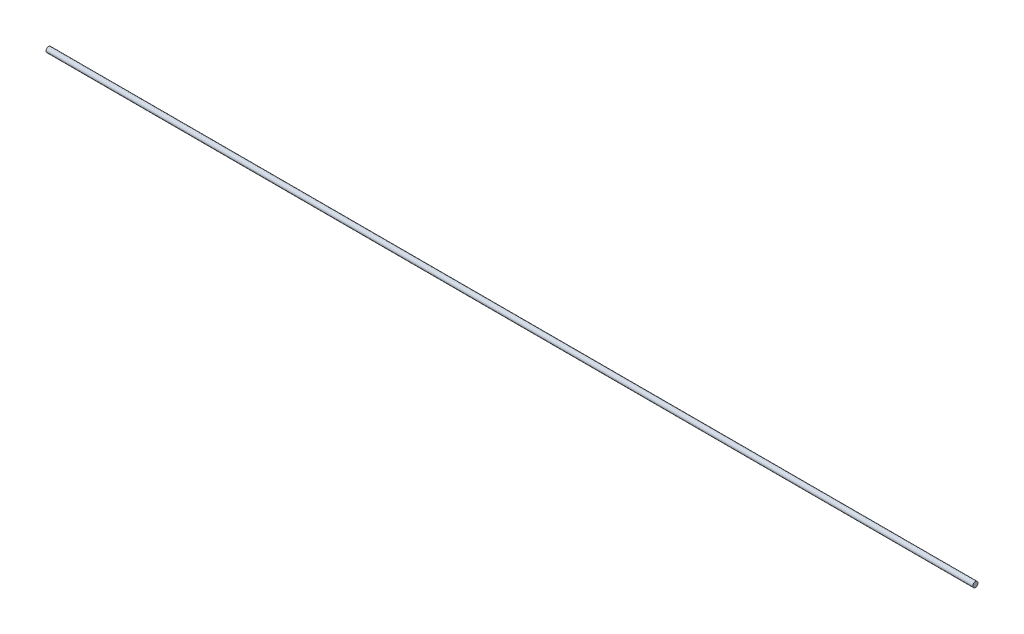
from build123d import *

# Parameters (mm, degrees)
SKETCH1_R           = 3
BOSS_EXTRUDE1_DEPTH = 1076


with BuildPart() as part:
    # Sketch1 → Boss-Extrude1 (new body)
    with BuildSketch(Plane(origin=(0, 0, 0), x_dir=(0, 0, -1), z_dir=(1, 0, 0))):
        Circle(SKETCH1_R)
    extrude(amount=BOSS_EXTRUDE1_DEPTH)


solid = part.part
